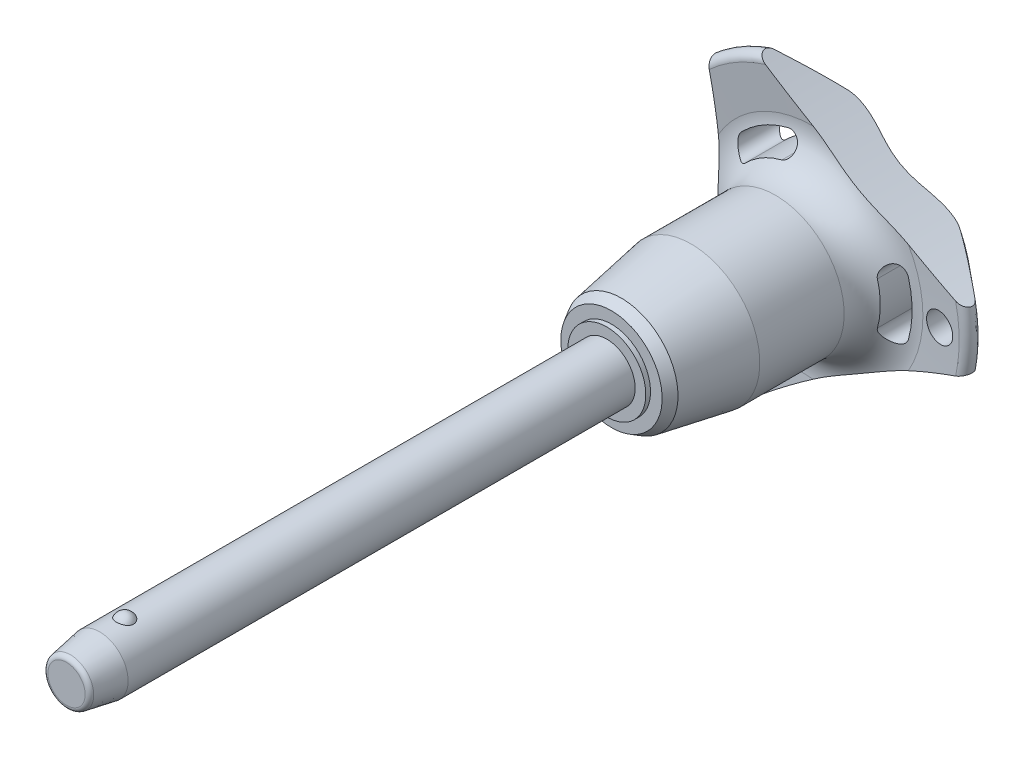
from build123d import *

# Parameters (mm, degrees)
SKETCH1_R           = 3
BOSS_EXTRUDE1_DEPTH = 50
SKETCH2_R           = 2.5
BOSS_EXTRUDE2_DEPTH = 26.7
BOSS_EXTRUDE3_START = 7
SKETCH1_2_R         = 3
BOSS_EXTRUDE3_DEPTH = 7
CHAMFER1_SIZE       = 3.5
CHAMFER1_SIZE2      = 0.617144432
FILLET1_R           = 0.5
SKETCH6_R           = 79.96
CUT_EXTRUDE1_DEPTH  = 81.212991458
CIRPATTERN1_COUNT   = 3
SKETCH7_R           = 1.5
CUT_EXTRUDE2_DEPTH  = 81.023009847


with BuildPart() as part:
    # Sketch1 → Boss-Extrude1 (new body)
    with BuildSketch(Plane.XY):
        Circle(SKETCH1_R)
    extrude(amount=-BOSS_EXTRUDE1_DEPTH)

    # Sketch2 → Boss-Extrude2 (add)
    with BuildSketch(Plane(origin=(0, 0, -50), x_dir=(-1, 0, 0), z_dir=(0, 0, -1))):
        Circle(SKETCH2_R)
    extrude(amount=BOSS_EXTRUDE2_DEPTH)

    # Sketch3 → Revolve1 (revolve)
    with BuildSketch(Plane(origin=(0, 0, 0), x_dir=(0, 0, -1), z_dir=(1, 0, 0))):
        with BuildLine():
            Line((-0.866025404, 3.5), (-0.866025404, 1.5))
            ThreePointArc((-0.866025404, 1.5), (0.133974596, 2.5), (-0.866025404, 3.5))
        make_face()
        with BuildLine():
            Line((-0.866025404, -1.5), (-0.866025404, -3.5))
            ThreePointArc((-0.866025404, -3.5), (0.133974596, -2.5), (-0.866025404, -1.5))
        make_face()
    revolve(axis=Axis((0, -1.5, 0.866025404), (0, 1, 0)))

    # Sketch1_2 → Boss-Extrude3 (add)
    with BuildSketch(Plane.XY.offset(BOSS_EXTRUDE3_START)):
        Circle(SKETCH1_2_R)
    extrude(amount=-BOSS_EXTRUDE3_DEPTH)

    # Chamfer1
    chamfer1_edges = [part.edges().sort_by_distance(p)[0] for p in [
        (-3, 0, 7),
    ]]
    chamfer1_side = [part.faces().sort_by_distance(p)[0] for p in [
        (-3, 0, -21.5),
    ]]
    chamfer(chamfer1_edges, length=CHAMFER1_SIZE, length2=CHAMFER1_SIZE2, reference=chamfer1_side[0])

    # Fillet1
    fillet1_edges = [part.edges().sort_by_distance(p)[0] for p in [
        (-2.382855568, 0, 7),
        (2.5, 0, -76.7),
    ]]
    fillet(fillet1_edges, radius=FILLET1_R)

    # Sketch4 → Revolve2 (revolve)
    with BuildSketch(Plane(origin=(0, 0, 0), x_dir=(0, 0, -1), z_dir=(1, 0, 0)), mode=Mode.PRIVATE) as revolve2_sk:
        Polygon((50, 0), (50, 4.118359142), (50.5, 4.118359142), (50.5, 5.343400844), (51.560917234, 5.955921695), (58.9, 7.25), (67.8, 7.25), (67.8, 0), align=None)
    revolve(revolve2_sk.sketch.rotate(Axis((0, 0, -67.8), (0, 0, 1)), 90), axis=Axis((0, 0, -67.8), (0, 0, 1)))

    # Sketch5 → Revolve3 (revolve)
    with BuildSketch(Plane(origin=(0, 0, 0), x_dir=(0, 0, -1), z_dir=(1, 0, 0)), mode=Mode.PRIVATE) as revolve3_sk:
        with BuildLine():
            Line((71.78715932, 11.570250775), (71.452568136, 15.735949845))
            ThreePointArc((71.452568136, 15.735949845), (71.946485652, 16.540188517), (72.862835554, 16.314230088))
            Line((72.862835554, 16.314230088), (76.326414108, 12.186497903))
            ThreePointArc((76.326414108, 12.186497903), (76.7, 11.109282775), (76.261488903, 10.056825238))
            ThreePointArc((76.261488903, 10.056825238), (73.289873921, 5.413681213), (72.25, 0))
            Line((72.25, 0), (67.8, 0))
            Line((67.8, 0), (67.8, 7.25))
            ThreePointArc((67.8, 7.25), (70.739473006, 8.537160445), (71.78715932, 11.570250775))
        make_face()
    revolve(revolve3_sk.sketch.rotate(Axis((0, 0, -72.25), (0, 0, 1)), 90), axis=Axis((0, 0, -72.25), (0, 0, 1)))

    # Sketch6 → Cut-Extrude1 (cut, through all)
    with BuildSketch(Plane.XY):
        with Locations((-89.76, 0)):
            Circle(SKETCH6_R)
        with BuildLine():
            ThreePointArc((10.099921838, -2.834717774), (10.490188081, 0), (10.099921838, 2.834717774))
            ThreePointArc((10.099921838, 2.834717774), (8.768180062, 3.582738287), (8.020159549, 2.250996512))
            ThreePointArc((8.020159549, 2.250996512), (8.330062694, 0), (8.020159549, -2.250996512))
            ThreePointArc((8.020159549, -2.250996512), (8.768180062, -3.582738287), (10.099921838, -2.834717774))
        make_face()
    cut_extrude1 = extrude(amount=-CUT_EXTRUDE1_DEPTH, mode=Mode.SUBTRACT)

    # CirPattern1: Cut-Extrude1 ×3 about axis
    cirpattern1_axis = Axis((0, 0, 0), (0, 0, 1))
    for i in range(1, CIRPATTERN1_COUNT):
        add(cut_extrude1.rotate(cirpattern1_axis, i * 360 / CIRPATTERN1_COUNT), mode=Mode.SUBTRACT)

    # Sketch7 → Cut-Extrude2 (cut, through all)
    with BuildSketch(Plane.XY):
        with Locations(Location((13.490188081, 0, 0), (0, 0, 225.221865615))):
            Circle(SKETCH7_R)
    extrude(amount=-CUT_EXTRUDE2_DEPTH, mode=Mode.SUBTRACT)


solid = part.part
